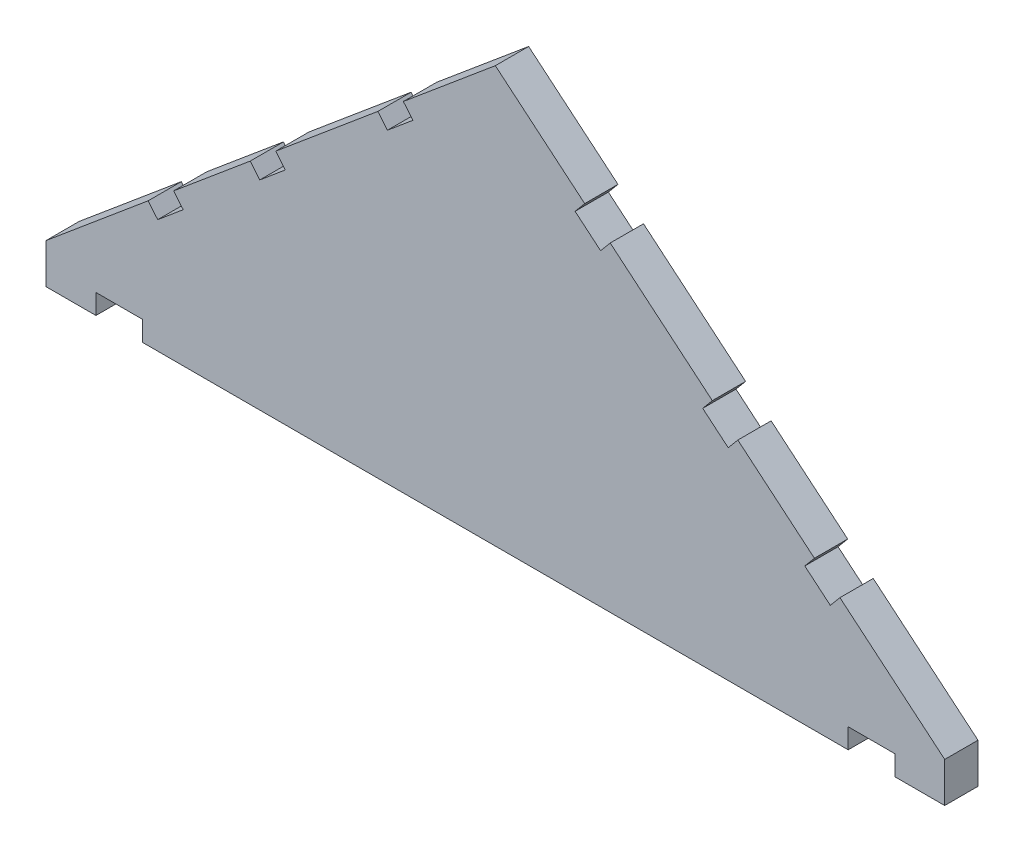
from build123d import *

# Parameters (mm, degrees)
ESQUISSE1_W                   = 270
ESQUISSE1_H                   = 125
EXTRUSION1_DEPTH              = 10
ENL_V_MAT_EXTRU_5_DEPTH       = 265.957512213
ENL_V_MAT_EXTRU_5_DEPTH_BACK  = 265.957512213
ESQUISSE11_W                  = 14
ESQUISSE11_H                  = 6
ENL_V_MAT_EXTRU_6_DEPTH       = 10
ENL_V_MAT_EXTRU_7_DEPTH       = 10
ENL_V_MAT_EXTRU_9_DEPTH       = 10
ENL_V_MAT_EXTRU_10_DEPTH      = 10
ENL_V_MAT_EXTRU_11_DEPTH      = 265.957512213
ENL_V_MAT_EXTRU_11_DEPTH_BACK = 265.957512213
ENL_V_MAT_EXTRU_20_DEPTH      = 10
ENL_V_MAT_EXTRU_21_DEPTH      = 10


with BuildPart() as part:
    # Esquisse1 → Extrusion1 (new body)
    with BuildSketch(Plane.XY):
        with Locations((68.404577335, -106.996493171)):
            Rectangle(ESQUISSE1_W, ESQUISSE1_H)
    extrude(amount=EXTRUSION1_DEPTH)

    # Esquisse2 → Enl_v. mat.-Extru.5 (cut, two sides: drawn at the far end of the back side and taken through both)
    with BuildSketch(Plane.XY.offset(10).offset(-ENL_V_MAT_EXTRU_5_DEPTH_BACK)):
        Polygon((-523.150412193, -539.64992885), (-66.595422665, -157.496493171), (68.404577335, -44.496493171), (203.404577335, -157.496493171), (659.959566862, -539.64992885), (659.959566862, 651.120757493), (-523.150412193, 651.120757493), align=None)
    extrude(amount=ENL_V_MAT_EXTRU_5_DEPTH + ENL_V_MAT_EXTRU_5_DEPTH_BACK, mode=Mode.SUBTRACT)

    # Esquisse11 → Enl_v. mat.-Extru.6 (cut)
    with BuildSketch(Plane.XY.offset(10)):
        with Locations((-44.595422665, -166.496493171)):
            Rectangle(ESQUISSE11_W, ESQUISSE11_H)
        with Locations((181.404577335, -166.496493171)):
            Rectangle(ESQUISSE11_W, ESQUISSE11_H)
    extrude(amount=-ENL_V_MAT_EXTRU_6_DEPTH, mode=Mode.SUBTRACT)

    # Esquisse14 → Enl_v. mat.-Extru.7 (cut)
    with BuildSketch(Plane.XY.offset(10)):
        Polygon((-35.922515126, -131.822133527), (-28.254288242, -125.403543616), (-25.365922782, -128.854245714), (-33.034149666, -135.272835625), align=None)
    extrude(amount=-ENL_V_MAT_EXTRU_7_DEPTH, mode=Mode.SUBTRACT)

    # Esquisse15 → Enl_v. mat.-Extru.9 (cut)
    with BuildSketch(Plane.XY.offset(10)):
        Polygon((-5.249607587, -106.147773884), (2.418619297, -99.729183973), (5.306984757, -103.179886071), (-2.361242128, -109.598475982), align=None)
    extrude(amount=-ENL_V_MAT_EXTRU_9_DEPTH, mode=Mode.SUBTRACT)

    # Esquisse16 → Enl_v. mat.-Extru.10 (cut)
    with BuildSketch(Plane.XY.offset(10)):
        Polygon((33.091526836, -74.054824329), (40.759753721, -67.636234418), (43.648119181, -71.086936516), (35.979892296, -77.505526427), align=None)
    extrude(amount=-ENL_V_MAT_EXTRU_10_DEPTH, mode=Mode.SUBTRACT)

    # Esquisse17 → Enl_v. mat.-Extru.11 (cut, two sides: drawn at the far end of the back side and taken through both)
    with BuildSketch(Plane.XY.offset(10).offset(-ENL_V_MAT_EXTRU_11_DEPTH_BACK)):
        Polygon((351.809099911, 239.555020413), (95.243371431, -66.961557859), (92.355005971, -70.412259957), (100.023232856, -76.830849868), (102.911598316, -73.38014777), (359.477326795, 233.136430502), (872.608783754, 846.169587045), (864.940556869, 852.588176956), align=None)
    extrude(amount=ENL_V_MAT_EXTRU_11_DEPTH + ENL_V_MAT_EXTRU_11_DEPTH_BACK, mode=Mode.SUBTRACT)

    # Esquisse20 → Enl_v. mat.-Extru.20 (cut)
    with BuildSketch(Plane.XY.offset(10)):
        Polygon((133.584505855, -99.054507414), (130.696140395, -102.505209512), (138.36436728, -108.923799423), (141.25273274, -105.473097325), align=None)
    extrude(amount=-ENL_V_MAT_EXTRU_20_DEPTH, mode=Mode.SUBTRACT)

    # Esquisse21 → Enl_v. mat.-Extru.21 (cut)
    with BuildSketch(Plane.XY.offset(10)):
        Polygon((164.257413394, -124.728867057), (161.369047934, -128.179569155), (169.037274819, -134.598159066), (171.925640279, -131.147456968), align=None)
    extrude(amount=-ENL_V_MAT_EXTRU_21_DEPTH, mode=Mode.SUBTRACT)


solid = part.part
